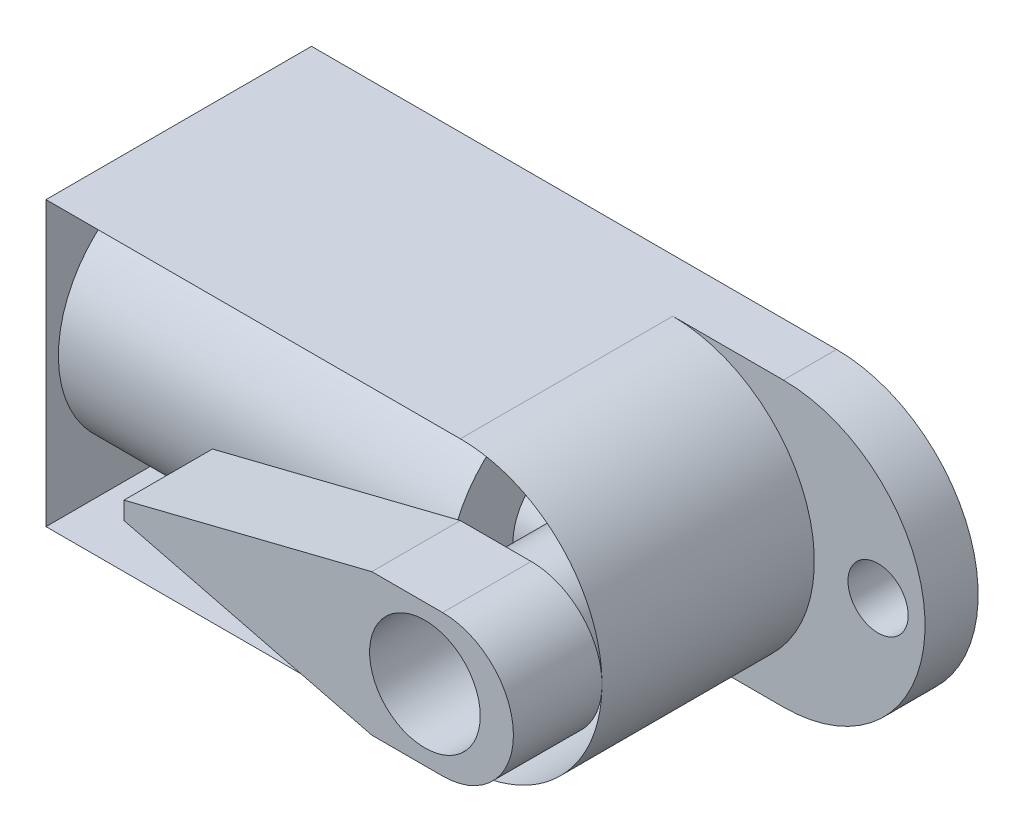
ISO-10303-21;
HEADER;
FILE_DESCRIPTION(('STEP AP214'),'2;1');
FILE_NAME('part.step','',(''),(''),'','','');
FILE_SCHEMA(('AUTOMOTIVE_DESIGN { 1 0 10303 214 1 1 1 1 }'));
ENDSEC;
DATA;
#1=APPLICATION_CONTEXT('core data for automotive mechanical design processes');
#2=APPLICATION_PROTOCOL_DEFINITION('international standard','automotive_design',2000,#1);
#3=PRODUCT_CONTEXT('',#1,'mechanical');
#4=PRODUCT('Part','Part','',(#3));
#5=PRODUCT_RELATED_PRODUCT_CATEGORY('part','',(#4));
#6=PRODUCT_DEFINITION_FORMATION('','',#4);
#7=PRODUCT_DEFINITION_CONTEXT('part definition',#1,'design');
#8=PRODUCT_DEFINITION('design','',#6,#7);
#9=PRODUCT_DEFINITION_SHAPE('','',#8);
#10=(LENGTH_UNIT() NAMED_UNIT(*) SI_UNIT(.MILLI.,.METRE.));
#11=(NAMED_UNIT(*) PLANE_ANGLE_UNIT() SI_UNIT($,.RADIAN.));
#12=(NAMED_UNIT(*) SI_UNIT($,.STERADIAN.) SOLID_ANGLE_UNIT());
#13=UNCERTAINTY_MEASURE_WITH_UNIT(LENGTH_MEASURE(1.E-05),#10,'distance_accuracy_value','');
#14=(GEOMETRIC_REPRESENTATION_CONTEXT(3) GLOBAL_UNCERTAINTY_ASSIGNED_CONTEXT((#13)) GLOBAL_UNIT_ASSIGNED_CONTEXT((#10,
#11,#12)) REPRESENTATION_CONTEXT('',''));
#15=CARTESIAN_POINT('',(0.,0.,0.));
#16=DIRECTION('',(0.,0.,1.));
#17=DIRECTION('',(1.,0.,0.));
#18=AXIS2_PLACEMENT_3D('',#15,#16,#17);
#19=CARTESIAN_POINT('',(25.7226223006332,10.16,25.4));
#20=DIRECTION('',(0.,0.,-1.));
#21=DIRECTION('',(-1.,0.,0.));
#22=AXIS2_PLACEMENT_3D('',#19,#20,#21);
#23=CYLINDRICAL_SURFACE('',#22,10.16);
#24=CARTESIAN_POINT('',(25.7226223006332,10.16,3.81));
#25=DIRECTION('',(0.,0.,1.));
#26=DIRECTION('',(1.,0.,0.));
#27=AXIS2_PLACEMENT_3D('',#24,#25,#26);
#28=CIRCLE('',#27,10.16);
#29=CARTESIAN_POINT('',(25.7226223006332,0.,3.81));
#30=VERTEX_POINT('',#29);
#31=CARTESIAN_POINT('',(25.7226223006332,20.32,3.81));
#32=VERTEX_POINT('',#31);
#33=EDGE_CURVE('E392',#30,#32,#28,.T.);
#34=ORIENTED_EDGE('',*,*,#33,.F.);
#35=DIRECTION('',(0.,0.,-1.));
#36=VECTOR('',#35,1.);
#37=CARTESIAN_POINT('',(25.7226223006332,0.,25.4));
#38=LINE('',#37,#36);
#39=CARTESIAN_POINT('',(25.7226223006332,0.,0.));
#40=VERTEX_POINT('',#39);
#41=EDGE_CURVE('E255',#30,#40,#38,.T.);
#42=ORIENTED_EDGE('',*,*,#41,.T.);
#43=CARTESIAN_POINT('',(25.7226223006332,10.16,0.));
#44=DIRECTION('',(0.,0.,1.));
#45=DIRECTION('',(-1.,0.,0.));
#46=AXIS2_PLACEMENT_3D('',#43,#44,#45);
#47=CIRCLE('',#46,10.16);
#48=CARTESIAN_POINT('',(25.7226223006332,20.32,0.));
#49=VERTEX_POINT('',#48);
#50=EDGE_CURVE('E240',#40,#49,#47,.T.);
#51=ORIENTED_EDGE('',*,*,#50,.T.);
#52=DIRECTION('',(0.,0.,-1.));
#53=VECTOR('',#52,1.);
#54=CARTESIAN_POINT('',(25.7226223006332,20.32,25.4));
#55=LINE('',#54,#53);
#56=EDGE_CURVE('E253',#32,#49,#55,.T.);
#57=ORIENTED_EDGE('',*,*,#56,.F.);
#58=EDGE_LOOP('',(#34,#42,#51,#57));
#59=FACE_BOUND('',#58,.T.);
#60=ADVANCED_FACE('F38',(#59),#23,.T.);
#61=CARTESIAN_POINT('',(32.512,10.16,50.8));
#62=DIRECTION('',(0.,0.,-1.));
#63=DIRECTION('',(-1.,0.,0.));
#64=AXIS2_PLACEMENT_3D('',#61,#62,#63);
#65=CYLINDRICAL_SURFACE('',#64,2.159);
#66=CARTESIAN_POINT('',(32.512,10.16,0.));
#67=DIRECTION('',(0.,0.,-1.));
#68=DIRECTION('',(-1.,0.,0.));
#69=AXIS2_PLACEMENT_3D('',#66,#67,#68);
#70=CIRCLE('',#69,2.159);
#71=CARTESIAN_POINT('',(30.353,10.16,0.));
#72=VERTEX_POINT('',#71);
#73=EDGE_CURVE('E233',#72,#72,#70,.T.);
#74=ORIENTED_EDGE('',*,*,#73,.T.);
#75=EDGE_LOOP('',(#74));
#76=FACE_BOUND('',#75,.T.);
#77=CARTESIAN_POINT('',(32.512,10.16,3.81));
#78=DIRECTION('',(0.,0.,1.));
#79=DIRECTION('',(1.,0.,0.));
#80=AXIS2_PLACEMENT_3D('',#77,#78,#79);
#81=CIRCLE('',#80,2.159);
#82=CARTESIAN_POINT('',(34.671,10.16,3.81));
#83=VERTEX_POINT('',#82);
#84=EDGE_CURVE('E398',#83,#83,#81,.F.);
#85=ORIENTED_EDGE('',*,*,#84,.F.);
#86=EDGE_LOOP('',(#85));
#87=FACE_BOUND('',#86,.T.);
#88=ADVANCED_FACE('F355',(#76,#87),#65,.F.);
#89=CARTESIAN_POINT('',(25.7226223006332,0.,25.4));
#90=DIRECTION('',(0.,1.,0.));
#91=DIRECTION('',(-1.,0.,0.));
#92=AXIS2_PLACEMENT_3D('',#89,#90,#91);
#93=PLANE('',#92);
#94=DIRECTION('',(1.,0.,0.));
#95=VECTOR('',#94,1.);
#96=CARTESIAN_POINT('',(25.7226223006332,0.,3.81));
#97=LINE('',#96,#95);
#98=CARTESIAN_POINT('',(17.78,0.,3.81));
#99=VERTEX_POINT('',#98);
#100=EDGE_CURVE('E194',#99,#30,#97,.T.);
#101=ORIENTED_EDGE('',*,*,#100,.F.);
#102=DIRECTION('',(0.,0.,1.));
#103=VECTOR('',#102,1.);
#104=CARTESIAN_POINT('',(17.78,0.,3.81));
#105=LINE('',#104,#103);
#106=CARTESIAN_POINT('',(17.78,0.,19.05));
#107=VERTEX_POINT('',#106);
#108=EDGE_CURVE('E179',#99,#107,#105,.T.);
#109=ORIENTED_EDGE('',*,*,#108,.T.);
#110=DIRECTION('',(1.,0.,0.));
#111=VECTOR('',#110,1.);
#112=CARTESIAN_POINT('',(25.7226223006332,0.,19.05));
#113=LINE('',#112,#111);
#114=CARTESIAN_POINT('',(-11.9455776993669,0.,19.05));
#115=VERTEX_POINT('',#114);
#116=EDGE_CURVE('E191',#115,#107,#113,.T.);
#117=ORIENTED_EDGE('',*,*,#116,.F.);
#118=DIRECTION('',(0.,0.,-1.));
#119=VECTOR('',#118,1.);
#120=CARTESIAN_POINT('',(-11.9455776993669,0.,25.4));
#121=LINE('',#120,#119);
#122=CARTESIAN_POINT('',(-11.9455776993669,0.,0.));
#123=VERTEX_POINT('',#122);
#124=EDGE_CURVE('E249',#115,#123,#121,.T.);
#125=ORIENTED_EDGE('',*,*,#124,.T.);
#126=DIRECTION('',(1.,0.,0.));
#127=VECTOR('',#126,1.);
#128=CARTESIAN_POINT('',(25.7226223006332,0.,0.));
#129=LINE('',#128,#127);
#130=EDGE_CURVE('E237',#123,#40,#129,.T.);
#131=ORIENTED_EDGE('',*,*,#130,.T.);
#132=ORIENTED_EDGE('',*,*,#41,.F.);
#133=EDGE_LOOP('',(#101,#109,#117,#125,#131,#132));
#134=FACE_BOUND('',#133,.T.);
#135=ADVANCED_FACE('F40',(#134),#93,.F.);
#136=CARTESIAN_POINT('',(5.40262230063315,20.32,25.4));
#137=DIRECTION('',(0.,-1.,0.));
#138=DIRECTION('',(0.,0.,-1.));
#139=AXIS2_PLACEMENT_3D('',#136,#137,#138);
#140=PLANE('',#139);
#141=DIRECTION('',(-1.,0.,0.));
#142=VECTOR('',#141,1.);
#143=CARTESIAN_POINT('',(5.40262230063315,20.32,19.05));
#144=LINE('',#143,#142);
#145=CARTESIAN_POINT('',(17.78,20.32,19.05));
#146=VERTEX_POINT('',#145);
#147=CARTESIAN_POINT('',(-11.9455776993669,20.32,19.05));
#148=VERTEX_POINT('',#147);
#149=EDGE_CURVE('E202',#146,#148,#144,.T.);
#150=ORIENTED_EDGE('',*,*,#149,.F.);
#151=DIRECTION('',(0.,0.,1.));
#152=VECTOR('',#151,1.);
#153=CARTESIAN_POINT('',(17.78,20.32,3.81));
#154=LINE('',#153,#152);
#155=CARTESIAN_POINT('',(17.78,20.32,3.81));
#156=VERTEX_POINT('',#155);
#157=EDGE_CURVE('E195',#156,#146,#154,.T.);
#158=ORIENTED_EDGE('',*,*,#157,.F.);
#159=DIRECTION('',(-1.,0.,0.));
#160=VECTOR('',#159,1.);
#161=CARTESIAN_POINT('',(5.40262230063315,20.32,3.81));
#162=LINE('',#161,#160);
#163=EDGE_CURVE('E394',#32,#156,#162,.T.);
#164=ORIENTED_EDGE('',*,*,#163,.F.);
#165=ORIENTED_EDGE('',*,*,#56,.T.);
#166=DIRECTION('',(-1.,0.,0.));
#167=VECTOR('',#166,1.);
#168=CARTESIAN_POINT('',(5.40262230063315,20.32,0.));
#169=LINE('',#168,#167);
#170=CARTESIAN_POINT('',(-11.9455776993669,20.32,0.));
#171=VERTEX_POINT('',#170);
#172=EDGE_CURVE('E243',#49,#171,#169,.T.);
#173=ORIENTED_EDGE('',*,*,#172,.T.);
#174=DIRECTION('',(0.,0.,-1.));
#175=VECTOR('',#174,1.);
#176=CARTESIAN_POINT('',(-11.9455776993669,20.32,25.4));
#177=LINE('',#176,#175);
#178=EDGE_CURVE('E251',#148,#171,#177,.T.);
#179=ORIENTED_EDGE('',*,*,#178,.F.);
#180=EDGE_LOOP('',(#150,#158,#164,#165,#173,#179));
#181=FACE_BOUND('',#180,.T.);
#182=ADVANCED_FACE('F363',(#181),#140,.F.);
#183=CARTESIAN_POINT('',(-11.9455776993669,20.32,25.4));
#184=DIRECTION('',(1.,0.,0.));
#185=DIRECTION('',(0.,0.,-1.));
#186=AXIS2_PLACEMENT_3D('',#183,#184,#185);
#187=PLANE('',#186);
#188=CARTESIAN_POINT('',(-11.9455776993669,10.16,9.525));
#189=DIRECTION('',(-1.,0.,0.));
#190=DIRECTION('',(0.,-1.,0.));
#191=AXIS2_PLACEMENT_3D('',#188,#189,#190);
#192=CIRCLE('',#191,8.636);
#193=CARTESIAN_POINT('',(-11.9455776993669,1.524,9.525));
#194=VERTEX_POINT('',#193);
#195=EDGE_CURVE('E221',#194,#194,#192,.T.);
#196=ORIENTED_EDGE('',*,*,#195,.F.);
#197=EDGE_LOOP('',(#196));
#198=FACE_BOUND('',#197,.T.);
#199=DIRECTION('',(0.,-1.,0.));
#200=VECTOR('',#199,1.);
#201=CARTESIAN_POINT('',(-11.9455776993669,20.32,19.05));
#202=LINE('',#201,#200);
#203=EDGE_CURVE('E200',#148,#115,#202,.T.);
#204=ORIENTED_EDGE('',*,*,#203,.F.);
#205=ORIENTED_EDGE('',*,*,#178,.T.);
#206=DIRECTION('',(0.,-1.,0.));
#207=VECTOR('',#206,1.);
#208=CARTESIAN_POINT('',(-11.9455776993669,20.32,0.));
#209=LINE('',#208,#207);
#210=EDGE_CURVE('E246',#171,#123,#209,.T.);
#211=ORIENTED_EDGE('',*,*,#210,.T.);
#212=ORIENTED_EDGE('',*,*,#124,.F.);
#213=EDGE_LOOP('',(#204,#205,#211,#212));
#214=FACE_BOUND('',#213,.T.);
#215=ADVANCED_FACE('F366',(#198,#214),#187,.F.);
#216=CARTESIAN_POINT('',(25.7226223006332,10.16,25.4));
#217=DIRECTION('',(0.,0.,-1.));
#218=DIRECTION('',(-1.,0.,0.));
#219=AXIS2_PLACEMENT_3D('',#216,#217,#218);
#220=PLANE('',#219);
#221=CARTESIAN_POINT('',(21.59,10.16,25.4));
#222=DIRECTION('',(0.,0.,1.));
#223=DIRECTION('',(1.,0.,0.));
#224=AXIS2_PLACEMENT_3D('',#221,#222,#223);
#225=CIRCLE('',#224,3.96875);
#226=CARTESIAN_POINT('',(25.55875,10.16,25.4));
#227=VERTEX_POINT('',#226);
#228=EDGE_CURVE('E201',#227,#227,#225,.T.);
#229=ORIENTED_EDGE('',*,*,#228,.F.);
#230=EDGE_LOOP('',(#229));
#231=FACE_BOUND('',#230,.T.);
#232=CARTESIAN_POINT('',(22.86,10.16,25.4));
#233=DIRECTION('',(0.,0.,1.));
#234=DIRECTION('',(-1.,0.,0.));
#235=AXIS2_PLACEMENT_3D('',#232,#233,#234);
#236=CIRCLE('',#235,5.08000000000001);
#237=CARTESIAN_POINT('',(22.86,5.08,25.4));
#238=VERTEX_POINT('',#237);
#239=CARTESIAN_POINT('',(22.86,15.24,25.4));
#240=VERTEX_POINT('',#239);
#241=EDGE_CURVE('E396',#238,#240,#236,.T.);
#242=ORIENTED_EDGE('',*,*,#241,.T.);
#243=DIRECTION('',(-1.,0.,0.));
#244=VECTOR('',#243,1.);
#245=CARTESIAN_POINT('',(17.78,15.24,25.4));
#246=LINE('',#245,#244);
#247=CARTESIAN_POINT('',(17.78,15.24,25.4));
#248=VERTEX_POINT('',#247);
#249=EDGE_CURVE('E403',#240,#248,#246,.T.);
#250=ORIENTED_EDGE('',*,*,#249,.T.);
#251=DIRECTION('',(-0.970142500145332,-0.242535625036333,0.));
#252=VECTOR('',#251,1.);
#253=CARTESIAN_POINT('',(17.78,15.24,25.4));
#254=LINE('',#253,#252);
#255=CARTESIAN_POINT('',(0.,10.795,25.4));
#256=VERTEX_POINT('',#255);
#257=EDGE_CURVE('E406',#248,#256,#254,.T.);
#258=ORIENTED_EDGE('',*,*,#257,.T.);
#259=DIRECTION('',(0.,-1.,0.));
#260=VECTOR('',#259,1.);
#261=CARTESIAN_POINT('',(0.,10.795,25.4));
#262=LINE('',#261,#260);
#263=CARTESIAN_POINT('',(0.,9.52499999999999,25.4));
#264=VERTEX_POINT('',#263);
#265=EDGE_CURVE('E409',#256,#264,#262,.T.);
#266=ORIENTED_EDGE('',*,*,#265,.T.);
#267=DIRECTION('',(0.970142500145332,-0.242535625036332,0.));
#268=VECTOR('',#267,1.);
#269=CARTESIAN_POINT('',(17.78,5.08000000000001,25.4));
#270=LINE('',#269,#268);
#271=CARTESIAN_POINT('',(17.78,5.08000000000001,25.4));
#272=VERTEX_POINT('',#271);
#273=EDGE_CURVE('E412',#264,#272,#270,.T.);
#274=ORIENTED_EDGE('',*,*,#273,.T.);
#275=DIRECTION('',(1.,0.,0.));
#276=VECTOR('',#275,1.);
#277=CARTESIAN_POINT('',(17.78,5.08000000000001,25.4));
#278=LINE('',#277,#276);
#279=EDGE_CURVE('E415',#272,#238,#278,.T.);
#280=ORIENTED_EDGE('',*,*,#279,.T.);
#281=EDGE_LOOP('',(#242,#250,#258,#266,#274,#280));
#282=FACE_BOUND('',#281,.T.);
#283=ADVANCED_FACE('F370',(#231,#282),#220,.F.);
#284=CARTESIAN_POINT('',(21.59,10.16,50.8));
#285=DIRECTION('',(0.,0.,-1.));
#286=DIRECTION('',(-1.,0.,0.));
#287=AXIS2_PLACEMENT_3D('',#284,#285,#286);
#288=CYLINDRICAL_SURFACE('',#287,1.27);
#289=CARTESIAN_POINT('',(21.59,10.16,0.));
#290=DIRECTION('',(0.,0.,-1.));
#291=DIRECTION('',(-1.,0.,0.));
#292=AXIS2_PLACEMENT_3D('',#289,#290,#291);
#293=CIRCLE('',#292,1.27);
#294=CARTESIAN_POINT('',(20.32,10.16,0.));
#295=VERTEX_POINT('',#294);
#296=EDGE_CURVE('E230',#295,#295,#293,.T.);
#297=ORIENTED_EDGE('',*,*,#296,.T.);
#298=EDGE_LOOP('',(#297));
#299=FACE_BOUND('',#298,.T.);
#300=CARTESIAN_POINT('',(21.59,10.16,5.842));
#301=DIRECTION('',(0.,0.,1.));
#302=DIRECTION('',(1.,0.,0.));
#303=AXIS2_PLACEMENT_3D('',#300,#301,#302);
#304=CIRCLE('',#303,1.27);
#305=CARTESIAN_POINT('',(21.5824223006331,11.4299773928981,5.842));
#306=VERTEX_POINT('',#305);
#307=CARTESIAN_POINT('',(21.5824223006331,8.89002260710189,5.842));
#308=VERTEX_POINT('',#307);
#309=EDGE_CURVE('E205',#306,#308,#304,.F.);
#310=ORIENTED_EDGE('',*,*,#309,.F.);
#311=DIRECTION('',(0.,0.,-1.));
#312=VECTOR('',#311,1.);
#313=CARTESIAN_POINT('',(21.5824223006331,11.4299773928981,50.8));
#314=LINE('',#313,#312);
#315=CARTESIAN_POINT('',(21.5824223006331,11.4299773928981,5.76492899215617));
#316=VERTEX_POINT('',#315);
#317=EDGE_CURVE('E267',#316,#306,#314,.F.);
#318=ORIENTED_EDGE('',*,*,#317,.F.);
#319=CARTESIAN_POINT('',(21.5824223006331,11.4299773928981,5.76492899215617));
#320=CARTESIAN_POINT('',(21.5476534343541,11.4297707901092,5.76486217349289));
#321=CARTESIAN_POINT('',(21.5129118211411,11.4281338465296,5.76430604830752));
#322=CARTESIAN_POINT('',(21.4437156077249,11.4220251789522,5.76225048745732));
#323=CARTESIAN_POINT('',(21.409260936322,11.4175541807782,5.76075129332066));
#324=CARTESIAN_POINT('',(21.3068991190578,11.3999706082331,5.75490586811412));
#325=CARTESIAN_POINT('',(21.2397368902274,11.3826854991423,5.74921076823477));
#326=CARTESIAN_POINT('',(21.1094645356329,11.3376006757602,5.73490973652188));
#327=CARTESIAN_POINT('',(21.0463524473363,11.3098060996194,5.7263052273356));
#328=CARTESIAN_POINT('',(20.9256322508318,11.2445392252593,5.70715965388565));
#329=CARTESIAN_POINT('',(20.8680272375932,11.2070615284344,5.69661751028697));
#330=CARTESIAN_POINT('',(20.7579208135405,11.1220496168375,5.67436039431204));
#331=CARTESIAN_POINT('',(20.7056478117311,11.0742266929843,5.66261834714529));
#332=CARTESIAN_POINT('',(20.6097127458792,10.9705108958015,5.63953120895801));
#333=CARTESIAN_POINT('',(20.5660521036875,10.9146166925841,5.6281861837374));
#334=CARTESIAN_POINT('',(20.4876331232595,10.7947673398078,5.60685893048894));
#335=CARTESIAN_POINT('',(20.4531000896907,10.7306576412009,5.59691360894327));
#336=CARTESIAN_POINT('',(20.3954003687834,10.5971666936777,5.57982808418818));
#337=CARTESIAN_POINT('',(20.3722303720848,10.5277869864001,5.57268706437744));
#338=CARTESIAN_POINT('',(20.3386695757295,10.3881582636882,5.56221589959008));
#339=CARTESIAN_POINT('',(20.3278820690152,10.3180135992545,5.55876770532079));
#340=CARTESIAN_POINT('',(20.3181428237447,10.1768296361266,5.55565820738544));
#341=CARTESIAN_POINT('',(20.3191885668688,10.1057905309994,5.55599609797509));
#342=CARTESIAN_POINT('',(20.3328187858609,9.96751265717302,5.56033811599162));
#343=CARTESIAN_POINT('',(20.3449916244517,9.90022857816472,5.56421144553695));
#344=CARTESIAN_POINT('',(20.3798662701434,9.76871286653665,5.57503454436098));
#345=CARTESIAN_POINT('',(20.4025687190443,9.70448142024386,5.58198450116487));
#346=CARTESIAN_POINT('',(20.4581546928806,9.57987530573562,5.59836810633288));
#347=CARTESIAN_POINT('',(20.491172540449,9.51956500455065,5.60783426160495));
#348=CARTESIAN_POINT('',(20.5663411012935,9.40521040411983,5.62825157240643));
#349=CARTESIAN_POINT('',(20.6084940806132,9.35116766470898,5.63920309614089));
#350=CARTESIAN_POINT('',(20.7028936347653,9.24839723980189,5.66198960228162));
#351=CARTESIAN_POINT('',(20.7554995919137,9.20000313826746,5.67384229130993));
#352=CARTESIAN_POINT('',(20.8682150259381,9.11261652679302,5.69668308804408));
#353=CARTESIAN_POINT('',(20.9283269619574,9.07362711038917,5.70767091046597));
#354=CARTESIAN_POINT('',(21.055263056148,9.00579174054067,5.72762603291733));
#355=CARTESIAN_POINT('',(21.1221571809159,8.97706909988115,5.7365683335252));
#356=CARTESIAN_POINT('',(21.2601506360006,8.93144023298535,5.75111595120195));
#357=CARTESIAN_POINT('',(21.3312427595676,8.91451436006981,5.75672681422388));
#358=CARTESIAN_POINT('',(21.4329229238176,8.89939267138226,5.76177506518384));
#359=CARTESIAN_POINT('',(21.4627355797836,8.89603593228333,5.76290241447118));
#360=CARTESIAN_POINT('',(21.5224988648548,8.89144232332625,5.7644491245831));
#361=CARTESIAN_POINT('',(21.5524492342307,8.89020241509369,5.76486950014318));
#362=CARTESIAN_POINT('',(21.5824223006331,8.89002260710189,5.76492899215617));
#363=B_SPLINE_CURVE_WITH_KNOTS('',3,(#319,#320,#321,#322,#323,#324,#325,#326,#327,#328,#329,
#330,#331,#332,#333,#334,#335,#336,#337,#338,#339,#340,#341,#342,#343,#344,#345,#346,#347,#348,
#349,#350,#351,#352,#353,#354,#355,#356,#357,#358,#359,#360,#361,#362),.UNSPECIFIED.,.F.,.F.,(4,
2,2,2,2,2,2,2,2,2,2,2,2,2,2,2,2,2,2,2,2,4),(0.,0.10424125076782,0.208455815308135,
0.416123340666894,0.623689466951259,0.831371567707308,1.04584311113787,1.26035003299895,
1.47974053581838,1.69906710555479,1.91115149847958,2.12319075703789,2.32768994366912,
2.53220159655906,2.73949587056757,2.94684162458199,3.16320933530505,3.37964812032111,
3.59860547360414,3.81719729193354,3.90719572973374,3.99706488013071),.UNSPECIFIED.);
#364=CARTESIAN_POINT('',(21.5824223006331,8.89002260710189,5.76492899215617));
#365=VERTEX_POINT('',#364);
#366=EDGE_CURVE('E259',#316,#365,#363,.T.);
#367=ORIENTED_EDGE('',*,*,#366,.T.);
#368=DIRECTION('',(0.,0.,-1.));
#369=VECTOR('',#368,1.);
#370=CARTESIAN_POINT('',(21.5824223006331,8.89002260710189,50.8));
#371=LINE('',#370,#369);
#372=EDGE_CURVE('E257',#308,#365,#371,.T.);
#373=ORIENTED_EDGE('',*,*,#372,.F.);
#374=EDGE_LOOP('',(#310,#318,#367,#373));
#375=FACE_BOUND('',#374,.T.);
#376=ADVANCED_FACE('F269',(#299,#375),#288,.F.);
#377=CARTESIAN_POINT('',(21.5824223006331,10.16,9.525));
#378=DIRECTION('',(-1.,0.,0.));
#379=DIRECTION('',(0.,-1.,0.));
#380=AXIS2_PLACEMENT_3D('',#377,#378,#379);
#381=PLANE('',#380);
#382=ORIENTED_EDGE('',*,*,#317,.T.);
#383=DIRECTION('',(0.,1.,0.));
#384=VECTOR('',#383,1.);
#385=CARTESIAN_POINT('',(21.5824223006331,10.16,5.842));
#386=LINE('',#385,#384);
#387=CARTESIAN_POINT('',(21.5824223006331,11.5887299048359,5.842));
#388=VERTEX_POINT('',#387);
#389=EDGE_CURVE('E212',#306,#388,#386,.T.);
#390=ORIENTED_EDGE('',*,*,#389,.T.);
#391=CARTESIAN_POINT('',(21.5824223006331,11.5887299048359,5.842));
#392=CARTESIAN_POINT('',(21.5824223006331,11.597269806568,5.84200000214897));
#393=CARTESIAN_POINT('',(21.5824223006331,11.6058092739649,5.84204306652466));
#394=CARTESIAN_POINT('',(21.5824223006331,11.6228873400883,5.84221531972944));
#395=CARTESIAN_POINT('',(21.5824223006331,11.6314259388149,5.84234450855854));
#396=CARTESIAN_POINT('',(21.5824223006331,11.6399641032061,5.84251675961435));
#397=B_SPLINE_CURVE_WITH_KNOTS('',3,(#391,#392,#393,#394,#395,#396),.UNSPECIFIED.,.F.,.F.,(4,2,
4),(0.,0.0256187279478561,0.0512374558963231),.UNSPECIFIED.);
#398=CARTESIAN_POINT('',(21.5824223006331,11.6399641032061,5.84251675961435));
#399=VERTEX_POINT('',#398);
#400=EDGE_CURVE('E288',#388,#399,#397,.T.);
#401=ORIENTED_EDGE('',*,*,#400,.T.);
#402=CARTESIAN_POINT('',(21.5824223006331,10.16,9.525));
#403=DIRECTION('',(-1.,0.,0.));
#404=DIRECTION('',(0.,-1.,0.));
#405=AXIS2_PLACEMENT_3D('',#402,#403,#404);
#406=CIRCLE('',#405,3.96875);
#407=EDGE_CURVE('E65',#399,#316,#406,.T.);
#408=ORIENTED_EDGE('',*,*,#407,.T.);
#409=EDGE_LOOP('',(#382,#390,#401,#408));
#410=FACE_BOUND('',#409,.T.);
#411=ADVANCED_FACE('F277',(#410),#381,.T.);
#412=CARTESIAN_POINT('',(21.5824223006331,8.68003589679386,5.84251675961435));
#413=VERTEX_POINT('',#412);
#414=EDGE_CURVE('E57',#365,#413,#406,.T.);
#415=ORIENTED_EDGE('',*,*,#414,.T.);
#416=CARTESIAN_POINT('',(21.5824223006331,8.68003589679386,5.84251675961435));
#417=CARTESIAN_POINT('',(21.5824223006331,8.68857406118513,5.84234450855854));
#418=CARTESIAN_POINT('',(21.5824223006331,8.69711265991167,5.84221531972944));
#419=CARTESIAN_POINT('',(21.5824223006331,8.71419072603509,5.84204306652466));
#420=CARTESIAN_POINT('',(21.5824223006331,8.72273019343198,5.84200000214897));
#421=CARTESIAN_POINT('',(21.5824223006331,8.73127009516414,5.842));
#422=B_SPLINE_CURVE_WITH_KNOTS('',3,(#416,#417,#418,#419,#420,#421),.UNSPECIFIED.,.F.,.F.,(4,2,
4),(0.,0.0256187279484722,0.0512374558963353),.UNSPECIFIED.);
#423=CARTESIAN_POINT('',(21.5824223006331,8.73127009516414,5.842));
#424=VERTEX_POINT('',#423);
#425=EDGE_CURVE('E12',#413,#424,#422,.T.);
#426=ORIENTED_EDGE('',*,*,#425,.T.);
#427=DIRECTION('',(0.,1.,0.));
#428=VECTOR('',#427,1.);
#429=CARTESIAN_POINT('',(21.5824223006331,10.16,5.842));
#430=LINE('',#429,#428);
#431=EDGE_CURVE('E469',#424,#308,#430,.T.);
#432=ORIENTED_EDGE('',*,*,#431,.T.);
#433=ORIENTED_EDGE('',*,*,#372,.T.);
#434=EDGE_LOOP('',(#415,#426,#432,#433));
#435=FACE_BOUND('',#434,.T.);
#436=ADVANCED_FACE('F276',(#435),#381,.T.);
#437=CARTESIAN_POINT('',(21.5824223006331,10.16,9.525));
#438=DIRECTION('',(-1.,0.,0.));
#439=DIRECTION('',(0.,-1.,0.));
#440=AXIS2_PLACEMENT_3D('',#437,#438,#439);
#441=CYLINDRICAL_SURFACE('',#440,3.96875);
#442=CARTESIAN_POINT('',(21.5824223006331,14.1287427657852,9.53257769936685));
#443=VERTEX_POINT('',#442);
#444=CARTESIAN_POINT('',(21.5824223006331,14.1287427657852,9.51742230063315));
#445=VERTEX_POINT('',#444);
#446=EDGE_CURVE('E234',#443,#445,#406,.T.);
#447=ORIENTED_EDGE('',*,*,#446,.F.);
#448=CARTESIAN_POINT('',(21.59,10.16,9.525));
#449=DIRECTION('',(-0.707106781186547,0.,-0.707106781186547));
#450=DIRECTION('',(-0.707106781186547,0.,0.707106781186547));
#451=AXIS2_PLACEMENT_3D('',#448,#449,#450);
#452=ELLIPSE('',#451,5.61266007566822,3.96875);
#453=CARTESIAN_POINT('',(21.5824223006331,6.19125723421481,9.53257769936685));
#454=VERTEX_POINT('',#453);
#455=EDGE_CURVE('E215',#443,#454,#452,.F.);
#456=ORIENTED_EDGE('',*,*,#455,.T.);
#457=CARTESIAN_POINT('',(21.5824223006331,6.19125723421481,9.51742230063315));
#458=VERTEX_POINT('',#457);
#459=EDGE_CURVE('E229',#458,#454,#406,.T.);
#460=ORIENTED_EDGE('',*,*,#459,.F.);
#461=CARTESIAN_POINT('',(21.59,10.16,9.525));
#462=DIRECTION('',(-0.707106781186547,0.,0.707106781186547));
#463=DIRECTION('',(-0.707106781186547,0.,-0.707106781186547));
#464=AXIS2_PLACEMENT_3D('',#461,#462,#463);
#465=ELLIPSE('',#464,5.61266007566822,3.96875);
#466=CARTESIAN_POINT('',(20.447,6.35940431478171,8.382));
#467=VERTEX_POINT('',#466);
#468=EDGE_CURVE('E220',#458,#467,#465,.F.);
#469=ORIENTED_EDGE('',*,*,#468,.T.);
#470=CARTESIAN_POINT('',(20.447,6.3594043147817,8.382));
#471=CARTESIAN_POINT('',(20.4031369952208,6.37258441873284,8.33813330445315));
#472=CARTESIAN_POINT('',(20.3614748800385,6.38713891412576,8.29253020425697));
#473=CARTESIAN_POINT('',(20.2825556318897,6.41911003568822,8.19867096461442));
#474=CARTESIAN_POINT('',(20.2452942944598,6.43652389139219,8.15041742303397));
#475=CARTESIAN_POINT('',(20.1752409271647,6.47427358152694,8.05219356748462));
#476=CARTESIAN_POINT('',(20.1424310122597,6.49459700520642,8.00223119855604));
#477=CARTESIAN_POINT('',(20.0810194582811,6.53827902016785,7.90106728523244));
#478=CARTESIAN_POINT('',(20.0524188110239,6.56163832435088,7.84986545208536));
#479=CARTESIAN_POINT('',(19.9729944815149,6.63615621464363,7.69567159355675));
#480=CARTESIAN_POINT('',(19.9282583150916,6.69191113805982,7.59167212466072));
#481=CARTESIAN_POINT('',(19.8545564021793,6.81538187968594,7.38513134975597));
#482=CARTESIAN_POINT('',(19.8256095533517,6.88311190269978,7.28259193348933));
#483=CARTESIAN_POINT('',(19.7818804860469,7.03436308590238,7.07575134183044));
#484=CARTESIAN_POINT('',(19.7681396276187,7.11862387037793,6.9717678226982));
#485=CARTESIAN_POINT('',(19.7586583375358,7.29778574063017,6.77243093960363));
#486=CARTESIAN_POINT('',(19.7629162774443,7.39268586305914,6.67707679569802));
#487=CARTESIAN_POINT('',(19.78822309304,7.57090130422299,6.51515961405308));
#488=CARTESIAN_POINT('',(19.8058586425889,7.65289838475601,6.44659791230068));
#489=CARTESIAN_POINT('',(19.855549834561,7.81936228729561,6.31823463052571));
#490=CARTESIAN_POINT('',(19.8875792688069,7.90382436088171,6.25841738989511));
#491=CARTESIAN_POINT('',(19.9550459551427,8.04208710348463,6.1679578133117));
#492=CARTESIAN_POINT('',(19.9854862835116,8.09640319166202,6.13437412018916));
#493=CARTESIAN_POINT('',(20.0551827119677,8.20225964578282,6.07217983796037));
#494=CARTESIAN_POINT('',(20.0944307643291,8.2538024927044,6.04356475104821));
#495=CARTESIAN_POINT('',(20.1741409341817,8.341344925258,5.99719202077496));
#496=CARTESIAN_POINT('',(20.2128247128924,8.37840160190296,5.97840640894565));
#497=CARTESIAN_POINT('',(20.2964968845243,8.44648585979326,5.94501695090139));
#498=CARTESIAN_POINT('',(20.3414548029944,8.47754094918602,5.93039387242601));
#499=CARTESIAN_POINT('',(20.4366815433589,8.53205290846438,5.90537592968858));
#500=CARTESIAN_POINT('',(20.4869371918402,8.55552806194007,5.89497087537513));
#501=CARTESIAN_POINT('',(20.5651574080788,8.58506527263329,5.88210684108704));
#502=CARTESIAN_POINT('',(20.5918740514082,8.5940015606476,5.87826132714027));
#503=CARTESIAN_POINT('',(20.6459424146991,8.61006467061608,5.87140559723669));
#504=CARTESIAN_POINT('',(20.6732939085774,8.61719212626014,5.86839508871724));
#505=CARTESIAN_POINT('',(20.7741582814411,8.64032589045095,5.85867747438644));
#506=CARTESIAN_POINT('',(20.8489788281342,8.65144708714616,5.85412278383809));
#507=CARTESIAN_POINT('',(20.9995896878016,8.66699219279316,5.84777955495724));
#508=CARTESIAN_POINT('',(21.0753830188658,8.67138102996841,5.84600550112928));
#509=CARTESIAN_POINT('',(21.2234254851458,8.67692931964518,5.84376576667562));
#510=CARTESIAN_POINT('',(21.2956693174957,8.67823426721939,5.84324112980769));
#511=CARTESIAN_POINT('',(21.4036672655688,8.67938314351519,5.8427791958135));
#512=CARTESIAN_POINT('',(21.4394207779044,8.67963210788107,5.84267908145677));
#513=CARTESIAN_POINT('',(21.5109233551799,8.67994915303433,5.84255159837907));
#514=CARTESIAN_POINT('',(21.5466724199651,8.68001726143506,5.84252421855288));
#515=CARTESIAN_POINT('',(21.582422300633,8.68003589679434,5.842516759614));
#516=B_SPLINE_CURVE_WITH_KNOTS('',3,(#470,#471,#472,#473,#474,#475,#476,#477,#478,#479,#480,
#481,#482,#483,#484,#485,#486,#487,#488,#489,#490,#491,#492,#493,#494,#495,#496,#497,#498,#499,
#500,#501,#502,#503,#504,#505,#506,#507,#508,#509,#510,#511,#512,#513,#514,#515),.UNSPECIFIED.,
.F.,.F.,(4,2,2,2,2,2,2,2,2,2,2,2,2,2,2,2,2,2,2,2,2,2,4),(0.,0.190128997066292,0.38007485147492,
0.569233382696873,0.758436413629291,1.13526250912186,1.51253862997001,1.91430315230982,
2.31603132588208,2.63991936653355,2.96322005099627,3.1748689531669,3.38632525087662,
3.55592237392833,3.72472268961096,3.89311274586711,3.97834562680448,4.06354860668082,
4.29009391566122,4.51781543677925,4.73455793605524,4.84182214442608,4.94906997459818),.UNSPECIFIED.);
#517=EDGE_CURVE('E51',#467,#413,#516,.T.);
#518=ORIENTED_EDGE('',*,*,#517,.T.);
#519=ORIENTED_EDGE('',*,*,#414,.F.);
#520=ORIENTED_EDGE('',*,*,#366,.F.);
#521=ORIENTED_EDGE('',*,*,#407,.F.);
#522=CARTESIAN_POINT('',(21.5824223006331,11.6399641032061,5.84251675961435));
#523=CARTESIAN_POINT('',(21.5326883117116,11.6400233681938,5.84254066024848));
#524=CARTESIAN_POINT('',(21.4829525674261,11.6401253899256,5.84258157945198));
#525=CARTESIAN_POINT('',(21.3834353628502,11.6407547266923,5.8428345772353));
#526=CARTESIAN_POINT('',(21.3336539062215,11.6412824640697,5.84304682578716));
#527=CARTESIAN_POINT('',(21.2326753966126,11.6431303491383,5.84379060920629));
#528=CARTESIAN_POINT('',(21.1814786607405,11.6444727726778,5.84433112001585));
#529=CARTESIAN_POINT('',(21.0791767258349,11.6487338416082,5.84605281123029));
#530=CARTESIAN_POINT('',(21.0280715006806,11.6516519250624,5.84723376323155));
#531=CARTESIAN_POINT('',(20.9036018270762,11.6619804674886,5.85143424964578));
#532=CARTESIAN_POINT('',(20.830345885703,11.6708033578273,5.85503443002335));
#533=CARTESIAN_POINT('',(20.6864499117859,11.6981376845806,5.86640061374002));
#534=CARTESIAN_POINT('',(20.6157910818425,11.7165516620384,5.87412473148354));
#535=CARTESIAN_POINT('',(20.4963077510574,11.760455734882,5.89320638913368));
#536=CARTESIAN_POINT('',(20.4462970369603,11.7832080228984,5.90325673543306));
#537=CARTESIAN_POINT('',(20.3513814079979,11.8361525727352,5.92745480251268));
#538=CARTESIAN_POINT('',(20.3064821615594,11.8663529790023,5.94160701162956));
#539=CARTESIAN_POINT('',(20.2231560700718,11.932434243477,5.97383302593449));
#540=CARTESIAN_POINT('',(20.1846975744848,11.9682855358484,5.99188659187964));
#541=CARTESIAN_POINT('',(20.1139376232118,12.043868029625,6.03159874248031));
#542=CARTESIAN_POINT('',(20.0816453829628,12.0836049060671,6.053262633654));
#543=CARTESIAN_POINT('',(20.005113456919,12.1896983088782,6.1137109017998));
#544=CARTESIAN_POINT('',(19.9652531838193,12.2577820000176,6.15499408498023));
#545=CARTESIAN_POINT('',(19.8974316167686,12.3952620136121,6.24454456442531));
#546=CARTESIAN_POINT('',(19.8695008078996,12.4646612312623,6.29282933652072));
#547=CARTESIAN_POINT('',(19.8150482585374,12.6283150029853,6.41496068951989));
#548=CARTESIAN_POINT('',(19.7930640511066,12.7220316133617,6.49156367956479));
#549=CARTESIAN_POINT('',(19.7655064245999,12.9031991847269,6.65433330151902));
#550=CARTESIAN_POINT('',(19.7599368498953,12.990648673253,6.74050216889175));
#551=CARTESIAN_POINT('',(19.7639760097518,13.1582138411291,6.92170878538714));
#552=CARTESIAN_POINT('',(19.7738072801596,13.2382039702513,7.01685754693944));
#553=CARTESIAN_POINT('',(19.8086540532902,13.3877538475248,7.21247836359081));
#554=CARTESIAN_POINT('',(19.8336769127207,13.4573085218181,7.31295297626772));
#555=CARTESIAN_POINT('',(19.9020358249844,13.5907374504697,7.52546541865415));
#556=CARTESIAN_POINT('',(19.9468299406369,13.6535204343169,7.63772406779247));
#557=CARTESIAN_POINT('',(20.0553280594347,13.7647557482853,7.86003977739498));
#558=CARTESIAN_POINT('',(20.1189945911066,13.8132360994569,7.97010074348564));
#559=CARTESIAN_POINT('',(20.2297639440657,13.8758653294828,8.12976076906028));
#560=CARTESIAN_POINT('',(20.269609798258,13.8951714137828,8.18247054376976));
#561=CARTESIAN_POINT('',(20.3544342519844,13.9303844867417,8.28479120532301));
#562=CARTESIAN_POINT('',(20.3994125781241,13.946291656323,8.33440225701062));
#563=CARTESIAN_POINT('',(20.447,13.9605956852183,8.38200000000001));
#564=B_SPLINE_CURVE_WITH_KNOTS('',3,(#522,#523,#524,#525,#526,#527,#528,#529,#530,#531,#532,
#533,#534,#535,#536,#537,#538,#539,#540,#541,#542,#543,#544,#545,#546,#547,#548,#549,#550,#551,
#552,#553,#554,#555,#556,#557,#558,#559,#560,#561,#562,#563),.UNSPECIFIED.,.F.,.F.,(4,2,2,2,2,2,
2,2,2,2,2,2,2,2,2,2,2,2,2,2,4),(0.,0.149204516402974,0.298557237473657,0.452190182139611,
0.605768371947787,0.826979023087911,1.04598449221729,1.21271953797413,1.37963772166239,
1.54570991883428,1.71202840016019,1.97765646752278,2.24395932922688,2.61109052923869,
2.97830770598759,3.35088015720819,3.72363317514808,4.13027357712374,4.53611193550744,
4.74232241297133,4.94852191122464),.UNSPECIFIED.);
#565=CARTESIAN_POINT('',(20.447,13.9605956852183,8.382));
#566=VERTEX_POINT('',#565);
#567=EDGE_CURVE('E283',#399,#566,#564,.T.);
#568=ORIENTED_EDGE('',*,*,#567,.T.);
#569=EDGE_CURVE('E218',#566,#445,#465,.F.);
#570=ORIENTED_EDGE('',*,*,#569,.T.);
#571=EDGE_LOOP('',(#447,#456,#460,#469,#518,#519,#520,#521,#568,#570));
#572=FACE_BOUND('',#571,.T.);
#573=CARTESIAN_POINT('',(15.9944223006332,10.16,9.525));
#574=DIRECTION('',(-1.,0.,0.));
#575=DIRECTION('',(0.,-1.,0.));
#576=AXIS2_PLACEMENT_3D('',#573,#574,#575);
#577=CIRCLE('',#576,3.96875);
#578=CARTESIAN_POINT('',(15.9944223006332,6.19125,9.525));
#579=VERTEX_POINT('',#578);
#580=EDGE_CURVE('E227',#579,#579,#577,.F.);
#581=ORIENTED_EDGE('',*,*,#580,.F.);
#582=EDGE_LOOP('',(#581));
#583=FACE_BOUND('',#582,.T.);
#584=ADVANCED_FACE('F272',(#572,#583),#441,.F.);
#585=CARTESIAN_POINT('',(25.7226223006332,10.16,0.));
#586=DIRECTION('',(0.,0.,-1.));
#587=DIRECTION('',(-1.,0.,0.));
#588=AXIS2_PLACEMENT_3D('',#585,#586,#587);
#589=PLANE('',#588);
#590=ORIENTED_EDGE('',*,*,#296,.F.);
#591=EDGE_LOOP('',(#590));
#592=FACE_BOUND('',#591,.T.);
#593=ORIENTED_EDGE('',*,*,#73,.F.);
#594=EDGE_LOOP('',(#593));
#595=FACE_BOUND('',#594,.T.);
#596=ORIENTED_EDGE('',*,*,#130,.F.);
#597=ORIENTED_EDGE('',*,*,#210,.F.);
#598=ORIENTED_EDGE('',*,*,#172,.F.);
#599=ORIENTED_EDGE('',*,*,#50,.F.);
#600=EDGE_LOOP('',(#596,#597,#598,#599));
#601=FACE_BOUND('',#600,.T.);
#602=ADVANCED_FACE('F275',(#592,#595,#601),#589,.T.);
#603=CARTESIAN_POINT('',(15.9944223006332,10.16,9.525));
#604=DIRECTION('',(-1.,0.,0.));
#605=DIRECTION('',(0.,-1.,0.));
#606=AXIS2_PLACEMENT_3D('',#603,#604,#605);
#607=PLANE('',#606);
#608=CARTESIAN_POINT('',(15.9944223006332,10.16,9.525));
#609=DIRECTION('',(-1.,0.,0.));
#610=DIRECTION('',(0.,-1.,0.));
#611=AXIS2_PLACEMENT_3D('',#608,#609,#610);
#612=CIRCLE('',#611,8.636);
#613=CARTESIAN_POINT('',(15.9944223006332,1.524,9.525));
#614=VERTEX_POINT('',#613);
#615=EDGE_CURVE('E224',#614,#614,#612,.T.);
#616=ORIENTED_EDGE('',*,*,#615,.T.);
#617=EDGE_LOOP('',(#616));
#618=FACE_BOUND('',#617,.T.);
#619=ORIENTED_EDGE('',*,*,#580,.T.);
#620=EDGE_LOOP('',(#619));
#621=FACE_BOUND('',#620,.T.);
#622=ADVANCED_FACE('F345',(#618,#621),#607,.T.);
#623=CARTESIAN_POINT('',(15.9944223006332,10.16,9.525));
#624=DIRECTION('',(-1.,0.,0.));
#625=DIRECTION('',(0.,-1.,0.));
#626=AXIS2_PLACEMENT_3D('',#623,#624,#625);
#627=CYLINDRICAL_SURFACE('',#626,8.636);
#628=ORIENTED_EDGE('',*,*,#615,.F.);
#629=EDGE_LOOP('',(#628));
#630=FACE_BOUND('',#629,.T.);
#631=ORIENTED_EDGE('',*,*,#195,.T.);
#632=EDGE_LOOP('',(#631));
#633=FACE_BOUND('',#632,.T.);
#634=ADVANCED_FACE('F343',(#630,#633),#627,.F.);
#635=CARTESIAN_POINT('',(21.59,10.16,5.842));
#636=DIRECTION('',(0.,0.,1.));
#637=DIRECTION('',(1.,0.,0.));
#638=AXIS2_PLACEMENT_3D('',#635,#636,#637);
#639=CYLINDRICAL_SURFACE('',#638,3.96875);
#640=ORIENTED_EDGE('',*,*,#228,.T.);
#641=EDGE_LOOP('',(#640));
#642=FACE_BOUND('',#641,.T.);
#643=ORIENTED_EDGE('',*,*,#569,.F.);
#644=CARTESIAN_POINT('',(21.59,10.16,8.382));
#645=DIRECTION('',(0.,0.,1.));
#646=DIRECTION('',(1.,0.,0.));
#647=AXIS2_PLACEMENT_3D('',#644,#645,#646);
#648=CIRCLE('',#647,3.96875);
#649=EDGE_CURVE('E472',#566,#467,#648,.F.);
#650=ORIENTED_EDGE('',*,*,#649,.T.);
#651=ORIENTED_EDGE('',*,*,#468,.F.);
#652=ORIENTED_EDGE('',*,*,#459,.T.);
#653=ORIENTED_EDGE('',*,*,#455,.F.);
#654=ORIENTED_EDGE('',*,*,#446,.T.);
#655=EDGE_LOOP('',(#643,#650,#651,#652,#653,#654));
#656=FACE_BOUND('',#655,.T.);
#657=ADVANCED_FACE('F339',(#642,#656),#639,.F.);
#658=CARTESIAN_POINT('',(21.59,10.16,5.842));
#659=DIRECTION('',(0.,0.,1.));
#660=DIRECTION('',(1.,0.,0.));
#661=AXIS2_PLACEMENT_3D('',#658,#659,#660);
#662=PLANE('',#661);
#663=ORIENTED_EDGE('',*,*,#431,.F.);
#664=CARTESIAN_POINT('',(21.59,10.16,5.842));
#665=DIRECTION('',(0.,0.,1.));
#666=DIRECTION('',(1.,0.,0.));
#667=AXIS2_PLACEMENT_3D('',#664,#665,#666);
#668=CIRCLE('',#667,1.42875);
#669=EDGE_CURVE('E470',#424,#388,#668,.T.);
#670=ORIENTED_EDGE('',*,*,#669,.T.);
#671=ORIENTED_EDGE('',*,*,#389,.F.);
#672=ORIENTED_EDGE('',*,*,#309,.T.);
#673=EDGE_LOOP('',(#663,#670,#671,#672));
#674=FACE_BOUND('',#673,.T.);
#675=ADVANCED_FACE('F336',(#674),#662,.T.);
#676=CARTESIAN_POINT('',(10.3227236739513,10.16,19.05));
#677=DIRECTION('',(0.,0.,1.));
#678=DIRECTION('',(1.,0.,0.));
#679=AXIS2_PLACEMENT_3D('',#676,#677,#678);
#680=PLANE('',#679);
#681=CARTESIAN_POINT('',(17.78,10.16,19.05));
#682=DIRECTION('',(0.,0.,-1.));
#683=DIRECTION('',(1.,0.,0.));
#684=AXIS2_PLACEMENT_3D('',#681,#682,#683);
#685=CIRCLE('',#684,10.16);
#686=CARTESIAN_POINT('',(27.94,10.16,19.05));
#687=VERTEX_POINT('',#686);
#688=EDGE_CURVE('E175',#687,#107,#685,.T.);
#689=ORIENTED_EDGE('',*,*,#688,.F.);
#690=CARTESIAN_POINT('',(22.86,10.16,19.05));
#691=DIRECTION('',(0.,0.,1.));
#692=DIRECTION('',(-1.,0.,0.));
#693=AXIS2_PLACEMENT_3D('',#690,#691,#692);
#694=CIRCLE('',#693,5.08000000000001);
#695=CARTESIAN_POINT('',(22.86,5.08,19.05));
#696=VERTEX_POINT('',#695);
#697=EDGE_CURVE('E419',#696,#687,#694,.T.);
#698=ORIENTED_EDGE('',*,*,#697,.F.);
#699=DIRECTION('',(1.,0.,0.));
#700=VECTOR('',#699,1.);
#701=CARTESIAN_POINT('',(17.78,5.08000000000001,19.05));
#702=LINE('',#701,#700);
#703=CARTESIAN_POINT('',(17.78,5.08000000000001,19.05));
#704=VERTEX_POINT('',#703);
#705=EDGE_CURVE('E434',#704,#696,#702,.T.);
#706=ORIENTED_EDGE('',*,*,#705,.F.);
#707=DIRECTION('',(0.970142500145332,-0.242535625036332,0.));
#708=VECTOR('',#707,1.);
#709=CARTESIAN_POINT('',(17.78,5.08000000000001,19.05));
#710=LINE('',#709,#708);
#711=CARTESIAN_POINT('',(0.,9.52499999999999,19.05));
#712=VERTEX_POINT('',#711);
#713=EDGE_CURVE('E431',#712,#704,#710,.T.);
#714=ORIENTED_EDGE('',*,*,#713,.F.);
#715=DIRECTION('',(0.,-1.,0.));
#716=VECTOR('',#715,1.);
#717=CARTESIAN_POINT('',(0.,10.795,19.05));
#718=LINE('',#717,#716);
#719=CARTESIAN_POINT('',(0.,10.795,19.05));
#720=VERTEX_POINT('',#719);
#721=EDGE_CURVE('E428',#720,#712,#718,.T.);
#722=ORIENTED_EDGE('',*,*,#721,.F.);
#723=DIRECTION('',(-0.970142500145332,-0.242535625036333,0.));
#724=VECTOR('',#723,1.);
#725=CARTESIAN_POINT('',(17.78,15.24,19.05));
#726=LINE('',#725,#724);
#727=CARTESIAN_POINT('',(17.78,15.24,19.05));
#728=VERTEX_POINT('',#727);
#729=EDGE_CURVE('E425',#728,#720,#726,.T.);
#730=ORIENTED_EDGE('',*,*,#729,.F.);
#731=DIRECTION('',(-1.,0.,0.));
#732=VECTOR('',#731,1.);
#733=CARTESIAN_POINT('',(17.78,15.24,19.05));
#734=LINE('',#733,#732);
#735=CARTESIAN_POINT('',(22.86,15.24,19.05));
#736=VERTEX_POINT('',#735);
#737=EDGE_CURVE('E422',#736,#728,#734,.T.);
#738=ORIENTED_EDGE('',*,*,#737,.F.);
#739=EDGE_CURVE('E418',#687,#736,#694,.T.);
#740=ORIENTED_EDGE('',*,*,#739,.F.);
#741=EDGE_CURVE('E182',#146,#687,#685,.T.);
#742=ORIENTED_EDGE('',*,*,#741,.F.);
#743=ORIENTED_EDGE('',*,*,#149,.T.);
#744=ORIENTED_EDGE('',*,*,#203,.T.);
#745=ORIENTED_EDGE('',*,*,#116,.T.);
#746=EDGE_LOOP('',(#689,#698,#706,#714,#722,#730,#738,#740,#742,#743,#744,#745));
#747=FACE_BOUND('',#746,.T.);
#748=ADVANCED_FACE('F198',(#747),#680,.T.);
#749=CARTESIAN_POINT('',(22.86,10.16,19.05));
#750=DIRECTION('',(0.,0.,1.));
#751=DIRECTION('',(1.,0.,0.));
#752=AXIS2_PLACEMENT_3D('',#749,#750,#751);
#753=CYLINDRICAL_SURFACE('',#752,5.08000000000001);
#754=ORIENTED_EDGE('',*,*,#241,.F.);
#755=DIRECTION('',(0.,0.,1.));
#756=VECTOR('',#755,1.);
#757=CARTESIAN_POINT('',(22.86,5.08,19.05));
#758=LINE('',#757,#756);
#759=EDGE_CURVE('E438',#696,#238,#758,.T.);
#760=ORIENTED_EDGE('',*,*,#759,.F.);
#761=ORIENTED_EDGE('',*,*,#697,.T.);
#762=ORIENTED_EDGE('',*,*,#739,.T.);
#763=DIRECTION('',(0.,0.,1.));
#764=VECTOR('',#763,1.);
#765=CARTESIAN_POINT('',(22.86,15.24,19.05));
#766=LINE('',#765,#764);
#767=EDGE_CURVE('E437',#736,#240,#766,.T.);
#768=ORIENTED_EDGE('',*,*,#767,.T.);
#769=EDGE_LOOP('',(#754,#760,#761,#762,#768));
#770=FACE_BOUND('',#769,.T.);
#771=ADVANCED_FACE('F315',(#770),#753,.T.);
#772=CARTESIAN_POINT('',(17.78,5.08000000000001,19.05));
#773=DIRECTION('',(0.,-1.,0.));
#774=DIRECTION('',(1.,0.,0.));
#775=AXIS2_PLACEMENT_3D('',#772,#773,#774);
#776=PLANE('',#775);
#777=ORIENTED_EDGE('',*,*,#279,.F.);
#778=DIRECTION('',(0.,0.,1.));
#779=VECTOR('',#778,1.);
#780=CARTESIAN_POINT('',(17.78,5.08000000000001,19.05));
#781=LINE('',#780,#779);
#782=EDGE_CURVE('E440',#704,#272,#781,.T.);
#783=ORIENTED_EDGE('',*,*,#782,.F.);
#784=ORIENTED_EDGE('',*,*,#705,.T.);
#785=ORIENTED_EDGE('',*,*,#759,.T.);
#786=EDGE_LOOP('',(#777,#783,#784,#785));
#787=FACE_BOUND('',#786,.T.);
#788=ADVANCED_FACE('F311',(#787),#776,.T.);
#789=CARTESIAN_POINT('',(17.78,5.08000000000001,19.05));
#790=DIRECTION('',(-0.242535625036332,-0.970142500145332,0.));
#791=DIRECTION('',(0.970142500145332,-0.242535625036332,0.));
#792=AXIS2_PLACEMENT_3D('',#789,#790,#791);
#793=PLANE('',#792);
#794=ORIENTED_EDGE('',*,*,#273,.F.);
#795=DIRECTION('',(0.,0.,1.));
#796=VECTOR('',#795,1.);
#797=CARTESIAN_POINT('',(0.,9.52499999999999,19.05));
#798=LINE('',#797,#796);
#799=EDGE_CURVE('E442',#712,#264,#798,.T.);
#800=ORIENTED_EDGE('',*,*,#799,.F.);
#801=ORIENTED_EDGE('',*,*,#713,.T.);
#802=ORIENTED_EDGE('',*,*,#782,.T.);
#803=EDGE_LOOP('',(#794,#800,#801,#802));
#804=FACE_BOUND('',#803,.T.);
#805=ADVANCED_FACE('F314',(#804),#793,.T.);
#806=CARTESIAN_POINT('',(0.,10.795,19.05));
#807=DIRECTION('',(-1.,0.,0.));
#808=DIRECTION('',(0.,0.,1.));
#809=AXIS2_PLACEMENT_3D('',#806,#807,#808);
#810=PLANE('',#809);
#811=ORIENTED_EDGE('',*,*,#265,.F.);
#812=DIRECTION('',(0.,0.,1.));
#813=VECTOR('',#812,1.);
#814=CARTESIAN_POINT('',(0.,10.795,19.05));
#815=LINE('',#814,#813);
#816=EDGE_CURVE('E444',#720,#256,#815,.T.);
#817=ORIENTED_EDGE('',*,*,#816,.F.);
#818=ORIENTED_EDGE('',*,*,#721,.T.);
#819=ORIENTED_EDGE('',*,*,#799,.T.);
#820=EDGE_LOOP('',(#811,#817,#818,#819));
#821=FACE_BOUND('',#820,.T.);
#822=ADVANCED_FACE('F319',(#821),#810,.T.);
#823=CARTESIAN_POINT('',(17.78,15.24,19.05));
#824=DIRECTION('',(-0.242535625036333,0.970142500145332,0.));
#825=DIRECTION('',(-0.970142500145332,-0.242535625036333,0.));
#826=AXIS2_PLACEMENT_3D('',#823,#824,#825);
#827=PLANE('',#826);
#828=ORIENTED_EDGE('',*,*,#257,.F.);
#829=DIRECTION('',(0.,0.,1.));
#830=VECTOR('',#829,1.);
#831=CARTESIAN_POINT('',(17.78,15.24,19.05));
#832=LINE('',#831,#830);
#833=EDGE_CURVE('E446',#728,#248,#832,.T.);
#834=ORIENTED_EDGE('',*,*,#833,.F.);
#835=ORIENTED_EDGE('',*,*,#729,.T.);
#836=ORIENTED_EDGE('',*,*,#816,.T.);
#837=EDGE_LOOP('',(#828,#834,#835,#836));
#838=FACE_BOUND('',#837,.T.);
#839=ADVANCED_FACE('F323',(#838),#827,.T.);
#840=CARTESIAN_POINT('',(17.78,15.24,19.05));
#841=DIRECTION('',(0.,1.,0.));
#842=DIRECTION('',(-1.,0.,0.));
#843=AXIS2_PLACEMENT_3D('',#840,#841,#842);
#844=PLANE('',#843);
#845=ORIENTED_EDGE('',*,*,#249,.F.);
#846=ORIENTED_EDGE('',*,*,#767,.F.);
#847=ORIENTED_EDGE('',*,*,#737,.T.);
#848=ORIENTED_EDGE('',*,*,#833,.T.);
#849=EDGE_LOOP('',(#845,#846,#847,#848));
#850=FACE_BOUND('',#849,.T.);
#851=ADVANCED_FACE('F307',(#850),#844,.T.);
#852=CARTESIAN_POINT('',(17.78,10.16,3.81));
#853=DIRECTION('',(0.,0.,1.));
#854=DIRECTION('',(1.,0.,0.));
#855=AXIS2_PLACEMENT_3D('',#852,#853,#854);
#856=PLANE('',#855);
#857=ORIENTED_EDGE('',*,*,#84,.T.);
#858=EDGE_LOOP('',(#857));
#859=FACE_BOUND('',#858,.T.);
#860=ORIENTED_EDGE('',*,*,#100,.T.);
#861=ORIENTED_EDGE('',*,*,#33,.T.);
#862=ORIENTED_EDGE('',*,*,#163,.T.);
#863=CARTESIAN_POINT('',(17.78,10.16,3.81));
#864=DIRECTION('',(0.,0.,-1.));
#865=DIRECTION('',(1.,0.,0.));
#866=AXIS2_PLACEMENT_3D('',#863,#864,#865);
#867=CIRCLE('',#866,10.16);
#868=EDGE_CURVE('E196',#156,#99,#867,.T.);
#869=ORIENTED_EDGE('',*,*,#868,.T.);
#870=EDGE_LOOP('',(#860,#861,#862,#869));
#871=FACE_BOUND('',#870,.T.);
#872=ADVANCED_FACE('F301',(#859,#871),#856,.T.);
#873=CARTESIAN_POINT('',(17.78,10.16,3.81));
#874=DIRECTION('',(0.,0.,1.));
#875=DIRECTION('',(1.,0.,0.));
#876=AXIS2_PLACEMENT_3D('',#873,#874,#875);
#877=CYLINDRICAL_SURFACE('',#876,10.16);
#878=ORIENTED_EDGE('',*,*,#741,.T.);
#879=ORIENTED_EDGE('',*,*,#688,.T.);
#880=ORIENTED_EDGE('',*,*,#108,.F.);
#881=ORIENTED_EDGE('',*,*,#868,.F.);
#882=ORIENTED_EDGE('',*,*,#157,.T.);
#883=EDGE_LOOP('',(#878,#879,#880,#881,#882));
#884=FACE_BOUND('',#883,.T.);
#885=ADVANCED_FACE('F177',(#884),#877,.T.);
#886=CARTESIAN_POINT('',(21.59,10.16,8.382));
#887=DIRECTION('',(0.,0.,1.));
#888=DIRECTION('',(1.,0.,0.));
#889=AXIS2_PLACEMENT_3D('',#886,#887,#888);
#890=DEGENERATE_TOROIDAL_SURFACE('',#889,1.42875,2.54,.T.);
#891=ORIENTED_EDGE('',*,*,#517,.F.);
#892=ORIENTED_EDGE('',*,*,#649,.F.);
#893=ORIENTED_EDGE('',*,*,#567,.F.);
#894=ORIENTED_EDGE('',*,*,#400,.F.);
#895=ORIENTED_EDGE('',*,*,#669,.F.);
#896=ORIENTED_EDGE('',*,*,#425,.F.);
#897=EDGE_LOOP('',(#891,#892,#893,#894,#895,#896));
#898=FACE_BOUND('',#897,.T.);
#899=ADVANCED_FACE('F296',(#898),#890,.F.);
#900=CLOSED_SHELL('',(#60,#88,#135,#182,#215,#283,#376,#411,#436,#584,#602,#622,#634,#657,#675,
#748,#771,#788,#805,#822,#839,#851,#872,#885,#899));
#901=MANIFOLD_SOLID_BREP('B2',#900);
#902=ADVANCED_BREP_SHAPE_REPRESENTATION('',(#18,#901),#14);
#903=SHAPE_DEFINITION_REPRESENTATION(#9,#902);
ENDSEC;
END-ISO-10303-21;
